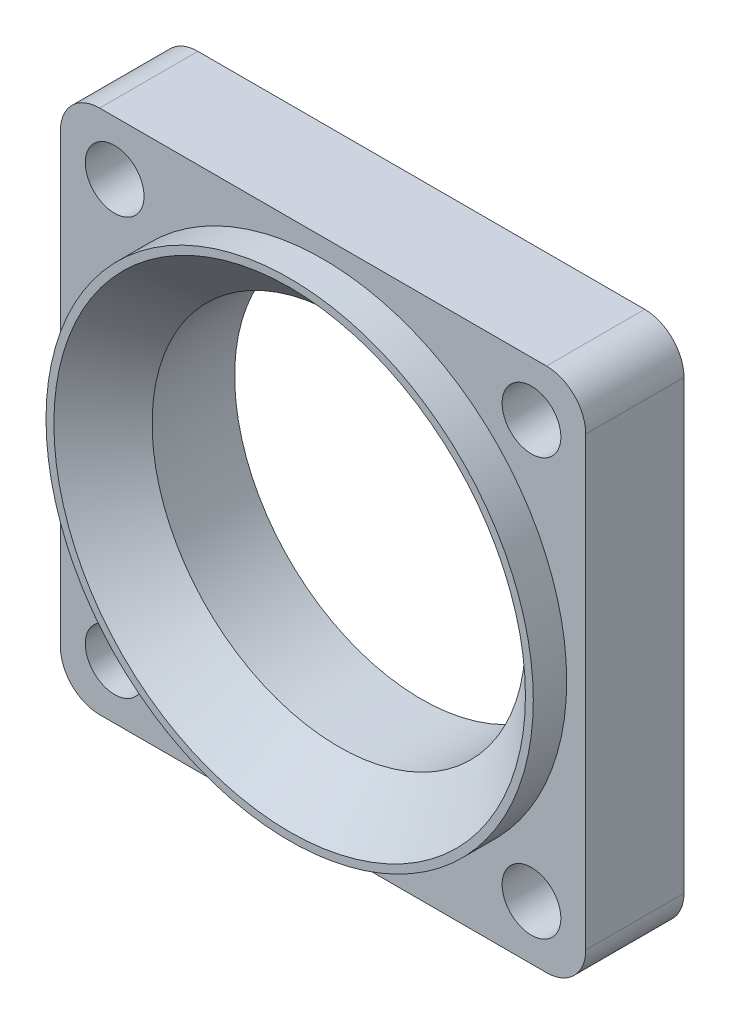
ISO-10303-21;
HEADER;
FILE_DESCRIPTION(('STEP AP214'),'2;1');
FILE_NAME('part.step','',(''),(''),'','','');
FILE_SCHEMA(('AUTOMOTIVE_DESIGN { 1 0 10303 214 1 1 1 1 }'));
ENDSEC;
DATA;
#1=APPLICATION_CONTEXT('core data for automotive mechanical design processes');
#2=APPLICATION_PROTOCOL_DEFINITION('international standard','automotive_design',2000,#1);
#3=PRODUCT_CONTEXT('',#1,'mechanical');
#4=PRODUCT('Part','Part','',(#3));
#5=PRODUCT_RELATED_PRODUCT_CATEGORY('part','',(#4));
#6=PRODUCT_DEFINITION_FORMATION('','',#4);
#7=PRODUCT_DEFINITION_CONTEXT('part definition',#1,'design');
#8=PRODUCT_DEFINITION('design','',#6,#7);
#9=PRODUCT_DEFINITION_SHAPE('','',#8);
#10=(LENGTH_UNIT() NAMED_UNIT(*) SI_UNIT(.MILLI.,.METRE.));
#11=(NAMED_UNIT(*) PLANE_ANGLE_UNIT() SI_UNIT($,.RADIAN.));
#12=(NAMED_UNIT(*) SI_UNIT($,.STERADIAN.) SOLID_ANGLE_UNIT());
#13=UNCERTAINTY_MEASURE_WITH_UNIT(LENGTH_MEASURE(1.E-05),#10,'distance_accuracy_value','');
#14=(GEOMETRIC_REPRESENTATION_CONTEXT(3) GLOBAL_UNCERTAINTY_ASSIGNED_CONTEXT((#13)) GLOBAL_UNIT_ASSIGNED_CONTEXT((#10,
#11,#12)) REPRESENTATION_CONTEXT('',''));
#15=CARTESIAN_POINT('',(0.,0.,0.));
#16=DIRECTION('',(0.,0.,1.));
#17=DIRECTION('',(1.,0.,0.));
#18=AXIS2_PLACEMENT_3D('',#15,#16,#17);
#19=CARTESIAN_POINT('',(0.,15.748,2.15900000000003));
#20=DIRECTION('',(0.,0.,-1.));
#21=DIRECTION('',(-1.,0.,0.));
#22=AXIS2_PLACEMENT_3D('',#19,#20,#21);
#23=PLANE('',#22);
#24=CARTESIAN_POINT('',(0.,0.,2.15900000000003));
#25=DIRECTION('',(0.,0.,1.));
#26=DIRECTION('',(1.,0.,0.));
#27=AXIS2_PLACEMENT_3D('',#24,#25,#26);
#28=CIRCLE('',#27,15.24);
#29=CARTESIAN_POINT('',(15.24,0.,2.15900000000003));
#30=VERTEX_POINT('',#29);
#31=EDGE_CURVE('E151',#30,#30,#28,.T.);
#32=ORIENTED_EDGE('',*,*,#31,.F.);
#33=EDGE_LOOP('',(#32));
#34=FACE_BOUND('',#33,.T.);
#35=CARTESIAN_POINT('',(0.,0.,2.15900000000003));
#36=DIRECTION('',(0.,0.,1.));
#37=DIRECTION('',(1.,0.,0.));
#38=AXIS2_PLACEMENT_3D('',#35,#36,#37);
#39=CIRCLE('',#38,15.748);
#40=CARTESIAN_POINT('',(15.748,0.,2.15900000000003));
#41=VERTEX_POINT('',#40);
#42=EDGE_CURVE('E208',#41,#41,#39,.T.);
#43=ORIENTED_EDGE('',*,*,#42,.T.);
#44=EDGE_LOOP('',(#43));
#45=FACE_BOUND('',#44,.T.);
#46=ADVANCED_FACE('F57',(#34,#45),#23,.F.);
#47=CARTESIAN_POINT('',(0.,0.,2.15900000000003));
#48=DIRECTION('',(0.,0.,1.));
#49=DIRECTION('',(1.,0.,0.));
#50=AXIS2_PLACEMENT_3D('',#47,#48,#49);
#51=CONICAL_SURFACE('',#50,15.24,0.785398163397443);
#52=CARTESIAN_POINT('',(0.,0.,-1.016));
#53=DIRECTION('',(0.,0.,1.));
#54=DIRECTION('',(1.,0.,0.));
#55=AXIS2_PLACEMENT_3D('',#52,#53,#54);
#56=CIRCLE('',#55,12.065);
#57=CARTESIAN_POINT('',(12.065,0.,-1.016));
#58=VERTEX_POINT('',#57);
#59=EDGE_CURVE('E158',#58,#58,#56,.T.);
#60=ORIENTED_EDGE('',*,*,#59,.F.);
#61=EDGE_LOOP('',(#60));
#62=FACE_BOUND('',#61,.T.);
#63=ORIENTED_EDGE('',*,*,#31,.T.);
#64=EDGE_LOOP('',(#63));
#65=FACE_BOUND('',#64,.T.);
#66=ADVANCED_FACE('F294',(#62,#65),#51,.F.);
#67=CARTESIAN_POINT('',(0.,0.,0.145825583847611));
#68=DIRECTION('',(0.,0.,1.));
#69=DIRECTION('',(1.,0.,0.));
#70=AXIS2_PLACEMENT_3D('',#67,#68,#69);
#71=CYLINDRICAL_SURFACE('',#70,12.065);
#72=CARTESIAN_POINT('',(0.,0.,-6.35));
#73=DIRECTION('',(0.,0.,1.));
#74=DIRECTION('',(1.,0.,0.));
#75=AXIS2_PLACEMENT_3D('',#72,#73,#74);
#76=CIRCLE('',#75,12.065);
#77=CARTESIAN_POINT('',(12.065,0.,-6.35));
#78=VERTEX_POINT('',#77);
#79=EDGE_CURVE('E231',#78,#78,#76,.T.);
#80=ORIENTED_EDGE('',*,*,#79,.F.);
#81=EDGE_LOOP('',(#80));
#82=FACE_BOUND('',#81,.T.);
#83=ORIENTED_EDGE('',*,*,#59,.T.);
#84=EDGE_LOOP('',(#83));
#85=FACE_BOUND('',#84,.T.);
#86=ADVANCED_FACE('F300',(#82,#85),#71,.F.);
#87=CARTESIAN_POINT('',(0.,16.9785031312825,-6.35));
#88=DIRECTION('',(0.,0.,1.));
#89=DIRECTION('',(1.,0.,0.));
#90=AXIS2_PLACEMENT_3D('',#87,#88,#89);
#91=PLANE('',#90);
#92=CARTESIAN_POINT('',(13.4703841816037,13.4703841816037,-6.35));
#93=DIRECTION('',(0.,0.,-1.));
#94=DIRECTION('',(-1.,0.,0.));
#95=AXIS2_PLACEMENT_3D('',#92,#93,#94);
#96=CIRCLE('',#95,1.89864999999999);
#97=CARTESIAN_POINT('',(11.5717341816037,13.4703841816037,-6.35));
#98=VERTEX_POINT('',#97);
#99=EDGE_CURVE('E264',#98,#98,#96,.T.);
#100=ORIENTED_EDGE('',*,*,#99,.F.);
#101=EDGE_LOOP('',(#100));
#102=FACE_BOUND('',#101,.T.);
#103=CARTESIAN_POINT('',(-13.4703841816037,13.4703841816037,-6.35));
#104=DIRECTION('',(0.,0.,-1.));
#105=DIRECTION('',(-1.,0.,0.));
#106=AXIS2_PLACEMENT_3D('',#103,#104,#105);
#107=CIRCLE('',#106,1.89864999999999);
#108=CARTESIAN_POINT('',(-15.3690341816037,13.4703841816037,-6.35));
#109=VERTEX_POINT('',#108);
#110=EDGE_CURVE('E249',#109,#109,#107,.T.);
#111=ORIENTED_EDGE('',*,*,#110,.F.);
#112=EDGE_LOOP('',(#111));
#113=FACE_BOUND('',#112,.T.);
#114=CARTESIAN_POINT('',(-13.4703841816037,-13.4703841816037,-6.35));
#115=DIRECTION('',(0.,0.,-1.));
#116=DIRECTION('',(-1.,0.,0.));
#117=AXIS2_PLACEMENT_3D('',#114,#115,#116);
#118=CIRCLE('',#117,1.89864999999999);
#119=CARTESIAN_POINT('',(-15.3690341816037,-13.4703841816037,-6.35));
#120=VERTEX_POINT('',#119);
#121=EDGE_CURVE('E245',#120,#120,#118,.T.);
#122=ORIENTED_EDGE('',*,*,#121,.F.);
#123=EDGE_LOOP('',(#122));
#124=FACE_BOUND('',#123,.T.);
#125=CARTESIAN_POINT('',(13.4703841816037,-13.4703841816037,-6.35));
#126=DIRECTION('',(0.,0.,-1.));
#127=DIRECTION('',(-1.,0.,0.));
#128=AXIS2_PLACEMENT_3D('',#125,#126,#127);
#129=CIRCLE('',#128,1.89864999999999);
#130=CARTESIAN_POINT('',(11.5717341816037,-13.4703841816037,-6.35));
#131=VERTEX_POINT('',#130);
#132=EDGE_CURVE('E241',#131,#131,#129,.T.);
#133=ORIENTED_EDGE('',*,*,#132,.F.);
#134=EDGE_LOOP('',(#133));
#135=FACE_BOUND('',#134,.T.);
#136=DIRECTION('',(0.,-1.,0.));
#137=VECTOR('',#136,1.);
#138=CARTESIAN_POINT('',(-16.9785031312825,16.9785031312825,-6.35));
#139=LINE('',#138,#137);
#140=CARTESIAN_POINT('',(-16.9785031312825,14.4385031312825,-6.35));
#141=VERTEX_POINT('',#140);
#142=CARTESIAN_POINT('',(-16.9785031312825,-14.4385031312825,-6.35));
#143=VERTEX_POINT('',#142);
#144=EDGE_CURVE('E146',#141,#143,#139,.T.);
#145=ORIENTED_EDGE('',*,*,#144,.F.);
#146=CARTESIAN_POINT('',(-14.4385031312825,14.4385031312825,-6.35));
#147=DIRECTION('',(0.,0.,1.));
#148=DIRECTION('',(1.,0.,0.));
#149=AXIS2_PLACEMENT_3D('',#146,#147,#148);
#150=CIRCLE('',#149,2.54);
#151=CARTESIAN_POINT('',(-14.4385031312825,16.9785031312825,-6.35));
#152=VERTEX_POINT('',#151);
#153=EDGE_CURVE('E186',#141,#152,#150,.F.);
#154=ORIENTED_EDGE('',*,*,#153,.T.);
#155=DIRECTION('',(-1.,0.,0.));
#156=VECTOR('',#155,1.);
#157=CARTESIAN_POINT('',(-16.9785031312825,16.9785031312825,-6.35));
#158=LINE('',#157,#156);
#159=CARTESIAN_POINT('',(14.4385031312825,16.9785031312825,-6.35));
#160=VERTEX_POINT('',#159);
#161=EDGE_CURVE('E202',#160,#152,#158,.T.);
#162=ORIENTED_EDGE('',*,*,#161,.F.);
#163=CARTESIAN_POINT('',(14.4385031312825,14.4385031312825,-6.35));
#164=DIRECTION('',(0.,0.,1.));
#165=DIRECTION('',(1.,0.,0.));
#166=AXIS2_PLACEMENT_3D('',#163,#164,#165);
#167=CIRCLE('',#166,2.54);
#168=CARTESIAN_POINT('',(16.9785031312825,14.4385031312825,-6.35));
#169=VERTEX_POINT('',#168);
#170=EDGE_CURVE('E149',#160,#169,#167,.F.);
#171=ORIENTED_EDGE('',*,*,#170,.T.);
#172=DIRECTION('',(0.,1.,0.));
#173=VECTOR('',#172,1.);
#174=CARTESIAN_POINT('',(16.9785031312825,16.9785031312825,-6.35));
#175=LINE('',#174,#173);
#176=CARTESIAN_POINT('',(16.9785031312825,-14.4385031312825,-6.35));
#177=VERTEX_POINT('',#176);
#178=EDGE_CURVE('E200',#177,#169,#175,.T.);
#179=ORIENTED_EDGE('',*,*,#178,.F.);
#180=CARTESIAN_POINT('',(14.4385031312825,-14.4385031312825,-6.35));
#181=DIRECTION('',(0.,0.,1.));
#182=DIRECTION('',(1.,0.,0.));
#183=AXIS2_PLACEMENT_3D('',#180,#181,#182);
#184=CIRCLE('',#183,2.54);
#185=CARTESIAN_POINT('',(14.4385031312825,-16.9785031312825,-6.35));
#186=VERTEX_POINT('',#185);
#187=EDGE_CURVE('E73',#177,#186,#184,.F.);
#188=ORIENTED_EDGE('',*,*,#187,.T.);
#189=DIRECTION('',(1.,0.,0.));
#190=VECTOR('',#189,1.);
#191=CARTESIAN_POINT('',(-16.9785031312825,-16.9785031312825,-6.35));
#192=LINE('',#191,#190);
#193=CARTESIAN_POINT('',(-14.4385031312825,-16.9785031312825,-6.35));
#194=VERTEX_POINT('',#193);
#195=EDGE_CURVE('E203',#194,#186,#192,.T.);
#196=ORIENTED_EDGE('',*,*,#195,.F.);
#197=CARTESIAN_POINT('',(-14.4385031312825,-14.4385031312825,-6.35));
#198=DIRECTION('',(0.,0.,1.));
#199=DIRECTION('',(1.,0.,0.));
#200=AXIS2_PLACEMENT_3D('',#197,#198,#199);
#201=CIRCLE('',#200,2.54);
#202=EDGE_CURVE('E183',#194,#143,#201,.F.);
#203=ORIENTED_EDGE('',*,*,#202,.T.);
#204=EDGE_LOOP('',(#145,#154,#162,#171,#179,#188,#196,#203));
#205=FACE_BOUND('',#204,.T.);
#206=ORIENTED_EDGE('',*,*,#79,.T.);
#207=EDGE_LOOP('',(#206));
#208=FACE_BOUND('',#207,.T.);
#209=ADVANCED_FACE('F317',(#102,#113,#124,#135,#205,#208),#91,.F.);
#210=CARTESIAN_POINT('',(0.,15.748,0.));
#211=DIRECTION('',(0.,0.,-1.));
#212=DIRECTION('',(-1.,0.,0.));
#213=AXIS2_PLACEMENT_3D('',#210,#211,#212);
#214=PLANE('',#213);
#215=CARTESIAN_POINT('',(13.4703841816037,13.4703841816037,0.));
#216=DIRECTION('',(0.,0.,-1.));
#217=DIRECTION('',(-1.,0.,0.));
#218=AXIS2_PLACEMENT_3D('',#215,#216,#217);
#219=CIRCLE('',#218,1.89864999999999);
#220=CARTESIAN_POINT('',(11.5717341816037,13.4703841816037,0.));
#221=VERTEX_POINT('',#220);
#222=EDGE_CURVE('E161',#221,#221,#219,.T.);
#223=ORIENTED_EDGE('',*,*,#222,.T.);
#224=EDGE_LOOP('',(#223));
#225=FACE_BOUND('',#224,.T.);
#226=CARTESIAN_POINT('',(-13.4703841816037,13.4703841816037,0.));
#227=DIRECTION('',(0.,0.,-1.));
#228=DIRECTION('',(-1.,0.,0.));
#229=AXIS2_PLACEMENT_3D('',#226,#227,#228);
#230=CIRCLE('',#229,1.89864999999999);
#231=CARTESIAN_POINT('',(-15.3690341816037,13.4703841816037,0.));
#232=VERTEX_POINT('',#231);
#233=EDGE_CURVE('E246',#232,#232,#230,.T.);
#234=ORIENTED_EDGE('',*,*,#233,.T.);
#235=EDGE_LOOP('',(#234));
#236=FACE_BOUND('',#235,.T.);
#237=CARTESIAN_POINT('',(-13.4703841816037,-13.4703841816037,0.));
#238=DIRECTION('',(0.,0.,-1.));
#239=DIRECTION('',(-1.,0.,0.));
#240=AXIS2_PLACEMENT_3D('',#237,#238,#239);
#241=CIRCLE('',#240,1.89864999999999);
#242=CARTESIAN_POINT('',(-15.3690341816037,-13.4703841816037,0.));
#243=VERTEX_POINT('',#242);
#244=EDGE_CURVE('E242',#243,#243,#241,.T.);
#245=ORIENTED_EDGE('',*,*,#244,.T.);
#246=EDGE_LOOP('',(#245));
#247=FACE_BOUND('',#246,.T.);
#248=CARTESIAN_POINT('',(13.4703841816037,-13.4703841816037,0.));
#249=DIRECTION('',(0.,0.,-1.));
#250=DIRECTION('',(-1.,0.,0.));
#251=AXIS2_PLACEMENT_3D('',#248,#249,#250);
#252=CIRCLE('',#251,1.89864999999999);
#253=CARTESIAN_POINT('',(11.5717341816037,-13.4703841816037,0.));
#254=VERTEX_POINT('',#253);
#255=EDGE_CURVE('E218',#254,#254,#252,.T.);
#256=ORIENTED_EDGE('',*,*,#255,.T.);
#257=EDGE_LOOP('',(#256));
#258=FACE_BOUND('',#257,.T.);
#259=CARTESIAN_POINT('',(0.,0.,0.));
#260=DIRECTION('',(0.,0.,1.));
#261=DIRECTION('',(1.,0.,0.));
#262=AXIS2_PLACEMENT_3D('',#259,#260,#261);
#263=CIRCLE('',#262,15.748);
#264=CARTESIAN_POINT('',(15.748,0.,0.));
#265=VERTEX_POINT('',#264);
#266=EDGE_CURVE('E227',#265,#265,#263,.T.);
#267=ORIENTED_EDGE('',*,*,#266,.F.);
#268=EDGE_LOOP('',(#267));
#269=FACE_BOUND('',#268,.T.);
#270=DIRECTION('',(-1.,0.,0.));
#271=VECTOR('',#270,1.);
#272=CARTESIAN_POINT('',(-16.9785031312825,16.9785031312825,0.));
#273=LINE('',#272,#271);
#274=CARTESIAN_POINT('',(14.4385031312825,16.9785031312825,0.));
#275=VERTEX_POINT('',#274);
#276=CARTESIAN_POINT('',(-14.4385031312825,16.9785031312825,0.));
#277=VERTEX_POINT('',#276);
#278=EDGE_CURVE('E127',#275,#277,#273,.T.);
#279=ORIENTED_EDGE('',*,*,#278,.T.);
#280=CARTESIAN_POINT('',(-14.4385031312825,14.4385031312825,0.));
#281=DIRECTION('',(0.,0.,-1.));
#282=DIRECTION('',(-1.,0.,0.));
#283=AXIS2_PLACEMENT_3D('',#280,#281,#282);
#284=CIRCLE('',#283,2.54);
#285=CARTESIAN_POINT('',(-16.9785031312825,14.4385031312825,0.));
#286=VERTEX_POINT('',#285);
#287=EDGE_CURVE('E169',#277,#286,#284,.F.);
#288=ORIENTED_EDGE('',*,*,#287,.T.);
#289=DIRECTION('',(0.,-1.,0.));
#290=VECTOR('',#289,1.);
#291=CARTESIAN_POINT('',(-16.9785031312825,16.9785031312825,0.));
#292=LINE('',#291,#290);
#293=CARTESIAN_POINT('',(-16.9785031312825,-14.4385031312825,0.));
#294=VERTEX_POINT('',#293);
#295=EDGE_CURVE('E213',#286,#294,#292,.T.);
#296=ORIENTED_EDGE('',*,*,#295,.T.);
#297=CARTESIAN_POINT('',(-14.4385031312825,-14.4385031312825,0.));
#298=DIRECTION('',(0.,0.,-1.));
#299=DIRECTION('',(-1.,0.,0.));
#300=AXIS2_PLACEMENT_3D('',#297,#298,#299);
#301=CIRCLE('',#300,2.54);
#302=CARTESIAN_POINT('',(-14.4385031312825,-16.9785031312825,0.));
#303=VERTEX_POINT('',#302);
#304=EDGE_CURVE('E166',#294,#303,#301,.F.);
#305=ORIENTED_EDGE('',*,*,#304,.T.);
#306=DIRECTION('',(1.,0.,0.));
#307=VECTOR('',#306,1.);
#308=CARTESIAN_POINT('',(-16.9785031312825,-16.9785031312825,0.));
#309=LINE('',#308,#307);
#310=CARTESIAN_POINT('',(14.4385031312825,-16.9785031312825,0.));
#311=VERTEX_POINT('',#310);
#312=EDGE_CURVE('E217',#303,#311,#309,.T.);
#313=ORIENTED_EDGE('',*,*,#312,.T.);
#314=CARTESIAN_POINT('',(14.4385031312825,-14.4385031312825,0.));
#315=DIRECTION('',(0.,0.,-1.));
#316=DIRECTION('',(-1.,0.,0.));
#317=AXIS2_PLACEMENT_3D('',#314,#315,#316);
#318=CIRCLE('',#317,2.54);
#319=CARTESIAN_POINT('',(16.9785031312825,-14.4385031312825,0.));
#320=VERTEX_POINT('',#319);
#321=EDGE_CURVE('E135',#311,#320,#318,.F.);
#322=ORIENTED_EDGE('',*,*,#321,.T.);
#323=DIRECTION('',(0.,1.,0.));
#324=VECTOR('',#323,1.);
#325=CARTESIAN_POINT('',(16.9785031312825,16.9785031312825,0.));
#326=LINE('',#325,#324);
#327=CARTESIAN_POINT('',(16.9785031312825,14.4385031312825,0.));
#328=VERTEX_POINT('',#327);
#329=EDGE_CURVE('E129',#320,#328,#326,.T.);
#330=ORIENTED_EDGE('',*,*,#329,.T.);
#331=CARTESIAN_POINT('',(14.4385031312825,14.4385031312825,0.));
#332=DIRECTION('',(0.,0.,-1.));
#333=DIRECTION('',(-1.,0.,0.));
#334=AXIS2_PLACEMENT_3D('',#331,#332,#333);
#335=CIRCLE('',#334,2.54);
#336=EDGE_CURVE('E124',#328,#275,#335,.F.);
#337=ORIENTED_EDGE('',*,*,#336,.T.);
#338=EDGE_LOOP('',(#279,#288,#296,#305,#313,#322,#330,#337));
#339=FACE_BOUND('',#338,.T.);
#340=ADVANCED_FACE('F126',(#225,#236,#247,#258,#269,#339),#214,.F.);
#341=CARTESIAN_POINT('',(0.,0.,0.145825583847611));
#342=DIRECTION('',(0.,0.,1.));
#343=DIRECTION('',(1.,0.,0.));
#344=AXIS2_PLACEMENT_3D('',#341,#342,#343);
#345=CYLINDRICAL_SURFACE('',#344,15.748);
#346=ORIENTED_EDGE('',*,*,#42,.F.);
#347=EDGE_LOOP('',(#346));
#348=FACE_BOUND('',#347,.T.);
#349=ORIENTED_EDGE('',*,*,#266,.T.);
#350=EDGE_LOOP('',(#349));
#351=FACE_BOUND('',#350,.T.);
#352=ADVANCED_FACE('F334',(#348,#351),#345,.T.);
#353=CARTESIAN_POINT('',(-16.9785031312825,16.9785031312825,-6.35));
#354=DIRECTION('',(-1.,0.,0.));
#355=DIRECTION('',(0.,0.,1.));
#356=AXIS2_PLACEMENT_3D('',#353,#354,#355);
#357=PLANE('',#356);
#358=ORIENTED_EDGE('',*,*,#295,.F.);
#359=DIRECTION('',(0.,0.,1.));
#360=VECTOR('',#359,1.);
#361=CARTESIAN_POINT('',(-16.9785031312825,14.4385031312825,-6.35));
#362=LINE('',#361,#360);
#363=EDGE_CURVE('E176',#286,#141,#362,.F.);
#364=ORIENTED_EDGE('',*,*,#363,.T.);
#365=ORIENTED_EDGE('',*,*,#144,.T.);
#366=DIRECTION('',(0.,0.,1.));
#367=VECTOR('',#366,1.);
#368=CARTESIAN_POINT('',(-16.9785031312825,-14.4385031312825,-6.35));
#369=LINE('',#368,#367);
#370=EDGE_CURVE('E172',#143,#294,#369,.T.);
#371=ORIENTED_EDGE('',*,*,#370,.T.);
#372=EDGE_LOOP('',(#358,#364,#365,#371));
#373=FACE_BOUND('',#372,.T.);
#374=ADVANCED_FACE('F276',(#373),#357,.T.);
#375=CARTESIAN_POINT('',(-16.9785031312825,16.9785031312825,-6.35));
#376=DIRECTION('',(0.,1.,0.));
#377=DIRECTION('',(0.,0.,1.));
#378=AXIS2_PLACEMENT_3D('',#375,#376,#377);
#379=PLANE('',#378);
#380=ORIENTED_EDGE('',*,*,#161,.T.);
#381=DIRECTION('',(0.,0.,1.));
#382=VECTOR('',#381,1.);
#383=CARTESIAN_POINT('',(-14.4385031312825,16.9785031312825,-6.35));
#384=LINE('',#383,#382);
#385=EDGE_CURVE('E136',#152,#277,#384,.T.);
#386=ORIENTED_EDGE('',*,*,#385,.T.);
#387=ORIENTED_EDGE('',*,*,#278,.F.);
#388=DIRECTION('',(0.,0.,1.));
#389=VECTOR('',#388,1.);
#390=CARTESIAN_POINT('',(14.4385031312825,16.9785031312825,-6.35));
#391=LINE('',#390,#389);
#392=EDGE_CURVE('E142',#275,#160,#391,.F.);
#393=ORIENTED_EDGE('',*,*,#392,.T.);
#394=EDGE_LOOP('',(#380,#386,#387,#393));
#395=FACE_BOUND('',#394,.T.);
#396=ADVANCED_FACE('F141',(#395),#379,.T.);
#397=CARTESIAN_POINT('',(16.9785031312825,16.9785031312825,-6.35));
#398=DIRECTION('',(1.,0.,0.));
#399=DIRECTION('',(0.,0.,-1.));
#400=AXIS2_PLACEMENT_3D('',#397,#398,#399);
#401=PLANE('',#400);
#402=ORIENTED_EDGE('',*,*,#329,.F.);
#403=DIRECTION('',(0.,0.,1.));
#404=VECTOR('',#403,1.);
#405=CARTESIAN_POINT('',(16.9785031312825,-14.4385031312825,-6.35));
#406=LINE('',#405,#404);
#407=EDGE_CURVE('E13',#320,#177,#406,.F.);
#408=ORIENTED_EDGE('',*,*,#407,.T.);
#409=ORIENTED_EDGE('',*,*,#178,.T.);
#410=DIRECTION('',(0.,0.,1.));
#411=VECTOR('',#410,1.);
#412=CARTESIAN_POINT('',(16.9785031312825,14.4385031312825,-6.35));
#413=LINE('',#412,#411);
#414=EDGE_CURVE('E66',#169,#328,#413,.T.);
#415=ORIENTED_EDGE('',*,*,#414,.T.);
#416=EDGE_LOOP('',(#402,#408,#409,#415));
#417=FACE_BOUND('',#416,.T.);
#418=ADVANCED_FACE('F198',(#417),#401,.T.);
#419=CARTESIAN_POINT('',(-16.9785031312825,-16.9785031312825,-6.35));
#420=DIRECTION('',(0.,-1.,0.));
#421=DIRECTION('',(0.,0.,-1.));
#422=AXIS2_PLACEMENT_3D('',#419,#420,#421);
#423=PLANE('',#422);
#424=ORIENTED_EDGE('',*,*,#312,.F.);
#425=DIRECTION('',(0.,0.,1.));
#426=VECTOR('',#425,1.);
#427=CARTESIAN_POINT('',(-14.4385031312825,-16.9785031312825,-6.35));
#428=LINE('',#427,#426);
#429=EDGE_CURVE('E80',#303,#194,#428,.F.);
#430=ORIENTED_EDGE('',*,*,#429,.T.);
#431=ORIENTED_EDGE('',*,*,#195,.T.);
#432=DIRECTION('',(0.,0.,1.));
#433=VECTOR('',#432,1.);
#434=CARTESIAN_POINT('',(14.4385031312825,-16.9785031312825,-6.35));
#435=LINE('',#434,#433);
#436=EDGE_CURVE('E189',#186,#311,#435,.T.);
#437=ORIENTED_EDGE('',*,*,#436,.T.);
#438=EDGE_LOOP('',(#424,#430,#431,#437));
#439=FACE_BOUND('',#438,.T.);
#440=ADVANCED_FACE('F282',(#439),#423,.T.);
#441=CARTESIAN_POINT('',(13.4703841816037,-13.4703841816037,-6.35));
#442=DIRECTION('',(0.,0.,-1.));
#443=DIRECTION('',(-1.,0.,0.));
#444=AXIS2_PLACEMENT_3D('',#441,#442,#443);
#445=CYLINDRICAL_SURFACE('',#444,1.89864999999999);
#446=ORIENTED_EDGE('',*,*,#132,.T.);
#447=EDGE_LOOP('',(#446));
#448=FACE_BOUND('',#447,.T.);
#449=ORIENTED_EDGE('',*,*,#255,.F.);
#450=EDGE_LOOP('',(#449));
#451=FACE_BOUND('',#450,.T.);
#452=ADVANCED_FACE('F341',(#448,#451),#445,.F.);
#453=CARTESIAN_POINT('',(-13.4703841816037,-13.4703841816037,-6.35));
#454=DIRECTION('',(0.,0.,-1.));
#455=DIRECTION('',(-1.,0.,0.));
#456=AXIS2_PLACEMENT_3D('',#453,#454,#455);
#457=CYLINDRICAL_SURFACE('',#456,1.89864999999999);
#458=ORIENTED_EDGE('',*,*,#121,.T.);
#459=EDGE_LOOP('',(#458));
#460=FACE_BOUND('',#459,.T.);
#461=ORIENTED_EDGE('',*,*,#244,.F.);
#462=EDGE_LOOP('',(#461));
#463=FACE_BOUND('',#462,.T.);
#464=ADVANCED_FACE('F348',(#460,#463),#457,.F.);
#465=CARTESIAN_POINT('',(-13.4703841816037,13.4703841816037,-6.35));
#466=DIRECTION('',(0.,0.,-1.));
#467=DIRECTION('',(-1.,0.,0.));
#468=AXIS2_PLACEMENT_3D('',#465,#466,#467);
#469=CYLINDRICAL_SURFACE('',#468,1.89864999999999);
#470=ORIENTED_EDGE('',*,*,#110,.T.);
#471=EDGE_LOOP('',(#470));
#472=FACE_BOUND('',#471,.T.);
#473=ORIENTED_EDGE('',*,*,#233,.F.);
#474=EDGE_LOOP('',(#473));
#475=FACE_BOUND('',#474,.T.);
#476=ADVANCED_FACE('F314',(#472,#475),#469,.F.);
#477=CARTESIAN_POINT('',(13.4703841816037,13.4703841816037,-6.35));
#478=DIRECTION('',(0.,0.,-1.));
#479=DIRECTION('',(-1.,0.,0.));
#480=AXIS2_PLACEMENT_3D('',#477,#478,#479);
#481=CYLINDRICAL_SURFACE('',#480,1.89864999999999);
#482=ORIENTED_EDGE('',*,*,#99,.T.);
#483=EDGE_LOOP('',(#482));
#484=FACE_BOUND('',#483,.T.);
#485=ORIENTED_EDGE('',*,*,#222,.F.);
#486=EDGE_LOOP('',(#485));
#487=FACE_BOUND('',#486,.T.);
#488=ADVANCED_FACE('F308',(#484,#487),#481,.F.);
#489=CARTESIAN_POINT('',(-14.4385031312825,14.4385031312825,-6.35));
#490=DIRECTION('',(0.,0.,1.));
#491=DIRECTION('',(1.,0.,0.));
#492=AXIS2_PLACEMENT_3D('',#489,#490,#491);
#493=CYLINDRICAL_SURFACE('',#492,2.54);
#494=ORIENTED_EDGE('',*,*,#153,.F.);
#495=ORIENTED_EDGE('',*,*,#363,.F.);
#496=ORIENTED_EDGE('',*,*,#287,.F.);
#497=ORIENTED_EDGE('',*,*,#385,.F.);
#498=EDGE_LOOP('',(#494,#495,#496,#497));
#499=FACE_BOUND('',#498,.T.);
#500=ADVANCED_FACE('F291',(#499),#493,.T.);
#501=CARTESIAN_POINT('',(-14.4385031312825,-14.4385031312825,-6.35));
#502=DIRECTION('',(0.,0.,1.));
#503=DIRECTION('',(1.,0.,0.));
#504=AXIS2_PLACEMENT_3D('',#501,#502,#503);
#505=CYLINDRICAL_SURFACE('',#504,2.54);
#506=ORIENTED_EDGE('',*,*,#202,.F.);
#507=ORIENTED_EDGE('',*,*,#429,.F.);
#508=ORIENTED_EDGE('',*,*,#304,.F.);
#509=ORIENTED_EDGE('',*,*,#370,.F.);
#510=EDGE_LOOP('',(#506,#507,#508,#509));
#511=FACE_BOUND('',#510,.T.);
#512=ADVANCED_FACE('F281',(#511),#505,.T.);
#513=CARTESIAN_POINT('',(14.4385031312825,-14.4385031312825,-6.35));
#514=DIRECTION('',(0.,0.,1.));
#515=DIRECTION('',(1.,0.,0.));
#516=AXIS2_PLACEMENT_3D('',#513,#514,#515);
#517=CYLINDRICAL_SURFACE('',#516,2.54);
#518=ORIENTED_EDGE('',*,*,#187,.F.);
#519=ORIENTED_EDGE('',*,*,#407,.F.);
#520=ORIENTED_EDGE('',*,*,#321,.F.);
#521=ORIENTED_EDGE('',*,*,#436,.F.);
#522=EDGE_LOOP('',(#518,#519,#520,#521));
#523=FACE_BOUND('',#522,.T.);
#524=ADVANCED_FACE('F285',(#523),#517,.T.);
#525=CARTESIAN_POINT('',(14.4385031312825,14.4385031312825,-6.35));
#526=DIRECTION('',(0.,0.,1.));
#527=DIRECTION('',(1.,0.,0.));
#528=AXIS2_PLACEMENT_3D('',#525,#526,#527);
#529=CYLINDRICAL_SURFACE('',#528,2.54);
#530=ORIENTED_EDGE('',*,*,#170,.F.);
#531=ORIENTED_EDGE('',*,*,#392,.F.);
#532=ORIENTED_EDGE('',*,*,#336,.F.);
#533=ORIENTED_EDGE('',*,*,#414,.F.);
#534=EDGE_LOOP('',(#530,#531,#532,#533));
#535=FACE_BOUND('',#534,.T.);
#536=ADVANCED_FACE('F59',(#535),#529,.T.);
#537=CLOSED_SHELL('',(#46,#66,#86,#209,#340,#352,#374,#396,#418,#440,#452,#464,#476,#488,#500,
#512,#524,#536));
#538=MANIFOLD_SOLID_BREP('B2',#537);
#539=ADVANCED_BREP_SHAPE_REPRESENTATION('',(#18,#538),#14);
#540=SHAPE_DEFINITION_REPRESENTATION(#9,#539);
ENDSEC;
END-ISO-10303-21;
